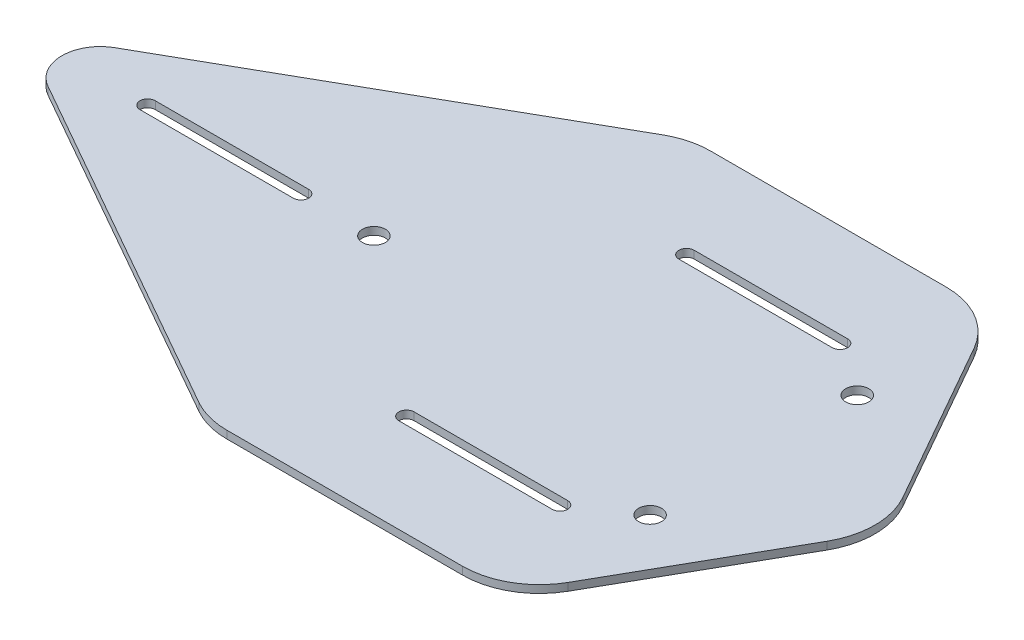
from build123d import *

# Parameters (mm, degrees)
SKIZZE1_R                       = 3
AUFSATZ_LINEAR_AUSTRAGEN1_DEPTH = 2


with BuildPart() as part:
    # Skizze1 → Aufsatz-Linear austragen1 (new body)
    with BuildSketch(Plane(origin=(0, 0, 0), x_dir=(1, 0, 0), z_dir=(0, 1, 0))):
        with BuildLine():
            Line((21.176889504, 63.041452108), (-40.303426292, 63.041452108))
            ThreePointArc((-40.303426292, 63.041452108), (-45.410949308, 62.378287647), (-50.179759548, 60.432772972))
            Line((-50.179759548, 60.432772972), (-141.284089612, 8.695660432))
            ThreePointArc((-141.284089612, 8.695660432), (-146.345922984, 0), (-141.284089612, -8.695660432))
            Line((-141.284089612, -8.695660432), (-50.179759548, -60.432772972))
            ThreePointArc((-50.179759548, -60.432772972), (-45.410949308, -62.378287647), (-40.303426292, -63.041452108))
            Line((-40.303426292, -63.041452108), (21.176889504, -63.041452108))
            ThreePointArc((21.176889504, -63.041452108), (31.23853288, -60.326223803), (38.568210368, -52.917785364))
            Line((38.568210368, -52.917785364), (63.010961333, -9.876333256))
            ThreePointArc((63.010961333, -9.876333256), (65.619640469, 0), (63.010961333, 9.876333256))
            Line((63.010961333, 9.876333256), (38.568210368, 52.917785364))
            ThreePointArc((38.568210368, 52.917785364), (31.23853288, 60.326223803), (21.176889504, 63.041452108))
        make_face()
        with Locations(Location((-65, 0, 0), (0, 0, 90))):
            Circle(SKIZZE1_R, mode=Mode.SUBTRACT)
        with Locations(Location((34, -27, 0), (0, 0, 90))):
            Circle(SKIZZE1_R, mode=Mode.SUBTRACT)
        with Locations(Location((34, 27, 0), (0, 0, 90))):
            Circle(SKIZZE1_R, mode=Mode.SUBTRACT)
        with BuildLine():
            Line((20, 34.5), (-20, 34.5))
            ThreePointArc((-20, 34.5), (-22, 36.5), (-20, 38.5))
            Line((-20, 38.5), (20, 38.5))
            ThreePointArc((20, 38.5), (22, 36.5), (20, 34.5))
        make_face(mode=Mode.SUBTRACT)
        with BuildLine():
            Line((20, -38.5), (-20, -38.5))
            ThreePointArc((-20, -38.5), (-22, -36.5), (-20, -34.5))
            Line((-20, -34.5), (20, -34.5))
            ThreePointArc((20, -34.5), (22, -36.5), (20, -38.5))
        make_face(mode=Mode.SUBTRACT)
        with BuildLine():
            Line((-124, 2), (-84, 2))
            ThreePointArc((-84, 2), (-82, 0), (-84, -2))
            Line((-84, -2), (-124, -2))
            ThreePointArc((-124, -2), (-126, 0), (-124, 2))
        make_face(mode=Mode.SUBTRACT)
    extrude(amount=AUFSATZ_LINEAR_AUSTRAGEN1_DEPTH)


solid = part.part
